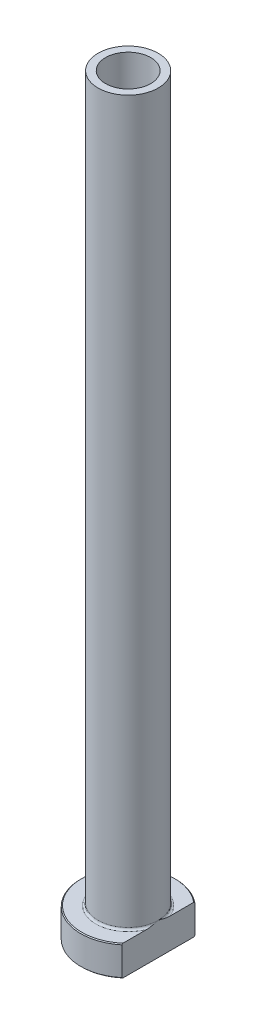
from build123d import *

# Parameters (mm, degrees)
FILLET1_R          = 0.5
CHAMFER1_SIZE      = 0.2
CUT_EXTRUDE1_DEPTH = 176.690068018
CHAMFER2_SIZE      = 0.5


with BuildPart() as part:
    # Sketch1 → Revolve1 (revolve)
    with BuildSketch(Plane.XY, mode=Mode.PRIVATE) as revolve1_sk:
        Polygon((-5.25, 175), (-7, 175), (-7, 7), (-11, 7), (-11, 0), (-5.5, 0), (-5.5, 108), (-5.25, 120), align=None)
    revolve(revolve1_sk.sketch.rotate(Axis((0, 92.187680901, 0), (0, -1, 0)), 270), axis=Axis((0, 92.187680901, 0), (0, -1, 0)))

    # Fillet1
    fillet1_edges = [part.edges().sort_by_distance(p)[0] for p in [
        (0, 7, -7),
    ]]
    fillet(fillet1_edges, radius=FILLET1_R)

    # Chamfer1
    chamfer1_edges = [part.edges().sort_by_distance(p)[0] for p in [
        (0, 0, -11),
        (0, 7, -11),
    ]]
    chamfer(chamfer1_edges, length=CHAMFER1_SIZE)

    # Sketch2 → Cut-Extrude1 (cut, through all)
    with BuildSketch(Plane.XZ):
        with BuildLine():
            Line((7, 8.485281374), (7, -8.485281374))
            ThreePointArc((7, -8.485281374), (11, 0), (7, 8.485281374))
        make_face()
    extrude(amount=-CUT_EXTRUDE1_DEPTH, mode=Mode.SUBTRACT)

    # Chamfer2
    chamfer2_edges = [part.edges().sort_by_distance(p)[0] for p in [
        (0, 0, -5.5),
    ]]
    chamfer(chamfer2_edges, length=CHAMFER2_SIZE)


solid = part.part
